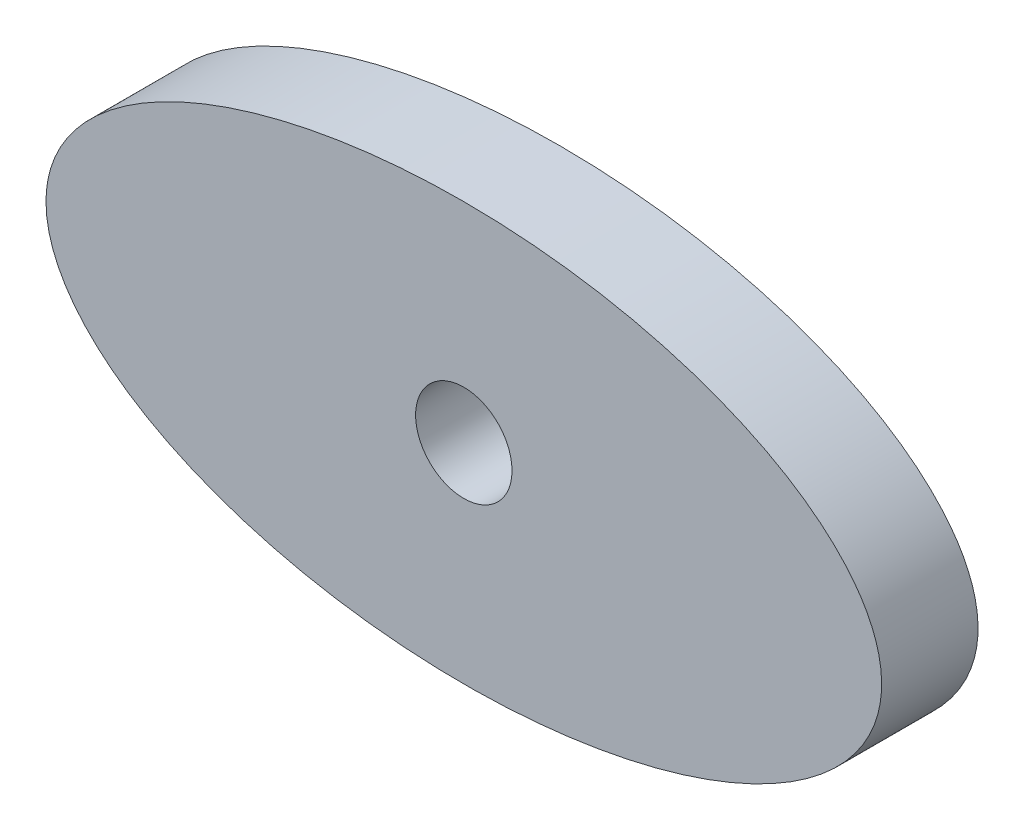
ISO-10303-21;
HEADER;
FILE_DESCRIPTION(('STEP AP214'),'2;1');
FILE_NAME('part.step','',(''),(''),'','','');
FILE_SCHEMA(('AUTOMOTIVE_DESIGN { 1 0 10303 214 1 1 1 1 }'));
ENDSEC;
DATA;
#1=APPLICATION_CONTEXT('core data for automotive mechanical design processes');
#2=APPLICATION_PROTOCOL_DEFINITION('international standard','automotive_design',2000,#1);
#3=PRODUCT_CONTEXT('',#1,'mechanical');
#4=PRODUCT('Part','Part','',(#3));
#5=PRODUCT_RELATED_PRODUCT_CATEGORY('part','',(#4));
#6=PRODUCT_DEFINITION_FORMATION('','',#4);
#7=PRODUCT_DEFINITION_CONTEXT('part definition',#1,'design');
#8=PRODUCT_DEFINITION('design','',#6,#7);
#9=PRODUCT_DEFINITION_SHAPE('','',#8);
#10=(LENGTH_UNIT() NAMED_UNIT(*) SI_UNIT(.MILLI.,.METRE.));
#11=(NAMED_UNIT(*) PLANE_ANGLE_UNIT() SI_UNIT($,.RADIAN.));
#12=(NAMED_UNIT(*) SI_UNIT($,.STERADIAN.) SOLID_ANGLE_UNIT());
#13=UNCERTAINTY_MEASURE_WITH_UNIT(LENGTH_MEASURE(1.E-05),#10,'distance_accuracy_value','');
#14=(GEOMETRIC_REPRESENTATION_CONTEXT(3) GLOBAL_UNCERTAINTY_ASSIGNED_CONTEXT((#13)) GLOBAL_UNIT_ASSIGNED_CONTEXT((#10,
#11,#12)) REPRESENTATION_CONTEXT('',''));
#15=CARTESIAN_POINT('',(0.,0.,0.));
#16=DIRECTION('',(0.,0.,1.));
#17=DIRECTION('',(1.,0.,0.));
#18=AXIS2_PLACEMENT_3D('',#15,#16,#17);
#19=CARTESIAN_POINT('',(0.,0.,7.5));
#20=DIRECTION('',(0.,0.,1.));
#21=DIRECTION('',(1.,0.,0.));
#22=AXIS2_PLACEMENT_3D('',#19,#20,#21);
#23=PLANE('',#22);
#24=CARTESIAN_POINT('',(0.,0.,7.5));
#25=DIRECTION('',(0.,0.,1.));
#26=DIRECTION('',(-1.,0.,0.));
#27=AXIS2_PLACEMENT_3D('',#24,#25,#26);
#28=ELLIPSE('',#27,65.,32.5);
#29=CARTESIAN_POINT('',(-65.,0.,7.5));
#30=VERTEX_POINT('',#29);
#31=EDGE_CURVE('E10',#30,#30,#28,.T.);
#32=ORIENTED_EDGE('',*,*,#31,.T.);
#33=EDGE_LOOP('',(#32));
#34=FACE_BOUND('',#33,.T.);
#35=CARTESIAN_POINT('',(0.,0.,7.5));
#36=DIRECTION('',(0.,0.,1.));
#37=DIRECTION('',(1.,0.,0.));
#38=AXIS2_PLACEMENT_3D('',#35,#36,#37);
#39=CIRCLE('',#38,7.5);
#40=CARTESIAN_POINT('',(7.5,0.,7.5));
#41=VERTEX_POINT('',#40);
#42=EDGE_CURVE('E46',#41,#41,#39,.T.);
#43=ORIENTED_EDGE('',*,*,#42,.F.);
#44=EDGE_LOOP('',(#43));
#45=FACE_BOUND('',#44,.T.);
#46=ADVANCED_FACE('F35',(#34,#45),#23,.T.);
#47=CARTESIAN_POINT('',(0.,0.,-7.5));
#48=DIRECTION('',(0.,0.,1.));
#49=DIRECTION('',(1.,0.,0.));
#50=AXIS2_PLACEMENT_3D('',#47,#48,#49);
#51=PLANE('',#50);
#52=CARTESIAN_POINT('',(0.,0.,-7.5));
#53=DIRECTION('',(0.,0.,1.));
#54=DIRECTION('',(-1.,0.,0.));
#55=AXIS2_PLACEMENT_3D('',#52,#53,#54);
#56=ELLIPSE('',#55,65.,32.5);
#57=CARTESIAN_POINT('',(-65.,0.,-7.5));
#58=VERTEX_POINT('',#57);
#59=EDGE_CURVE('E40',#58,#58,#56,.T.);
#60=ORIENTED_EDGE('',*,*,#59,.F.);
#61=EDGE_LOOP('',(#60));
#62=FACE_BOUND('',#61,.T.);
#63=CARTESIAN_POINT('',(0.,0.,-7.5));
#64=DIRECTION('',(0.,0.,1.));
#65=DIRECTION('',(1.,0.,0.));
#66=AXIS2_PLACEMENT_3D('',#63,#64,#65);
#67=CIRCLE('',#66,7.5);
#68=CARTESIAN_POINT('',(7.5,0.,-7.5));
#69=VERTEX_POINT('',#68);
#70=EDGE_CURVE('E49',#69,#69,#67,.T.);
#71=ORIENTED_EDGE('',*,*,#70,.T.);
#72=EDGE_LOOP('',(#71));
#73=FACE_BOUND('',#72,.T.);
#74=ADVANCED_FACE('F59',(#62,#73),#51,.F.);
#75=DIRECTION('',(0.,0.,-1.));
#76=VECTOR('',#75,1.);
#77=SURFACE_OF_LINEAR_EXTRUSION('',#28,#76);
#78=ORIENTED_EDGE('',*,*,#31,.F.);
#79=EDGE_LOOP('',(#78));
#80=FACE_BOUND('',#79,.T.);
#81=ORIENTED_EDGE('',*,*,#59,.T.);
#82=EDGE_LOOP('',(#81));
#83=FACE_BOUND('',#82,.T.);
#84=ADVANCED_FACE('F37',(#80,#83),#77,.F.);
#85=CARTESIAN_POINT('',(0.,0.,7.5));
#86=DIRECTION('',(0.,0.,-1.));
#87=DIRECTION('',(-1.,0.,0.));
#88=AXIS2_PLACEMENT_3D('',#85,#86,#87);
#89=CYLINDRICAL_SURFACE('',#88,7.5);
#90=ORIENTED_EDGE('',*,*,#42,.T.);
#91=EDGE_LOOP('',(#90));
#92=FACE_BOUND('',#91,.T.);
#93=ORIENTED_EDGE('',*,*,#70,.F.);
#94=EDGE_LOOP('',(#93));
#95=FACE_BOUND('',#94,.T.);
#96=ADVANCED_FACE('F55',(#92,#95),#89,.F.);
#97=CLOSED_SHELL('',(#46,#74,#84,#96));
#98=MANIFOLD_SOLID_BREP('B2',#97);
#99=ADVANCED_BREP_SHAPE_REPRESENTATION('',(#18,#98),#14);
#100=SHAPE_DEFINITION_REPRESENTATION(#9,#99);
ENDSEC;
END-ISO-10303-21;
